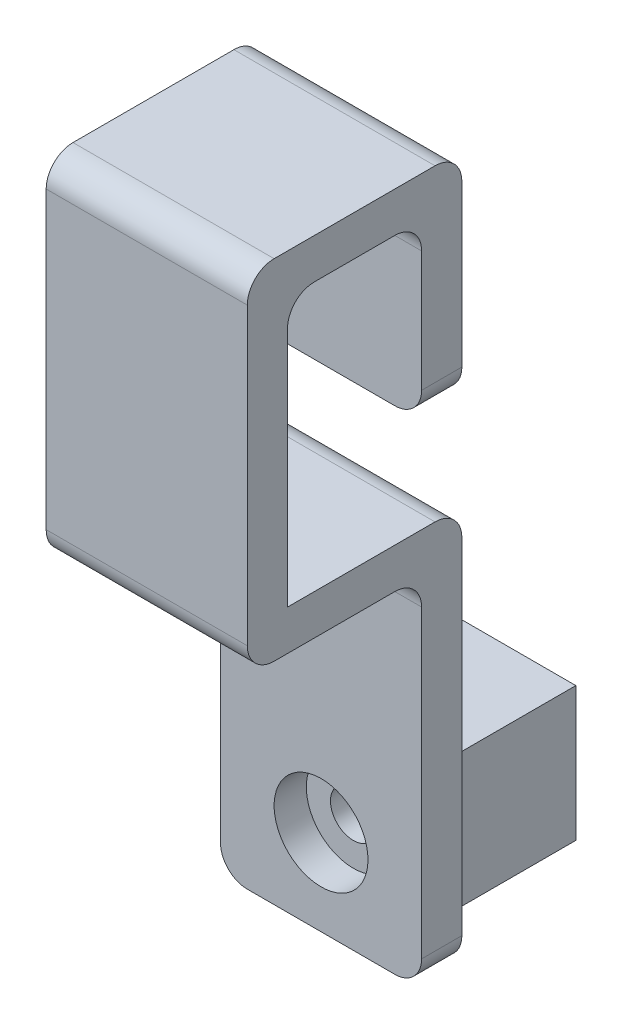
from build123d import *

# Parameters (mm, degrees)
SZKIC1_W                                          = 10
SZKIC1_H                                          = 10
DODANIE_WYCI_GNI_CIE1_DEPTH                       = 11
SZKIC2_W                                          = 15
SZKIC2_H                                          = 29.721694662
DODANIE_WYCI_GNI_CIE2_DEPTH                       = 3
SZKIC3_W                                          = 15
SZKIC3_H                                          = 3
DODANIE_WYCI_GNI_CIE3_DEPTH                       = 13
POG_BIENIE_WALCOWE_POD_M3_RUB_Z_BEM_S_D           = 3.4
POG_BIENIE_WALCOWE_POD_M3_RUB_Z_BEM_S_CBORE_D     = 7
POG_BIENIE_WALCOWE_POD_M3_RUB_Z_BEM_S_CBORE_DEPTH = 2.4
ZAOKR_GLENIE1_R                                   = 2
ZAOKR_GLENIE2_R                                   = 2
SZKIC6_W                                          = 15
SZKIC6_H                                          = 3
DODANIE_WYCI_GNI_CIE4_DEPTH                       = 23
SZKIC7_W                                          = 15
SZKIC7_H                                          = 3
DODANIE_WYCI_GNI_CIE5_DEPTH                       = 13
SZKIC8_W                                          = 15
SZKIC8_H                                          = 3
DODANIE_WYCI_GNI_CIE6_DEPTH                       = 13
ZAOKR_GLENIE3_R                                   = 2
ZAOKR_GLENIE4_R                                   = 2


with BuildPart() as part:
    # Szkic1 → Dodanie-wyci_gni_cie1 (new body)
    with BuildSketch(Plane.XY):
        Rectangle(SZKIC1_W, SZKIC1_H)
    extrude(amount=DODANIE_WYCI_GNI_CIE1_DEPTH)

    # Szkic2 → Dodanie-wyci_gni_cie2 (add)
    with BuildSketch(Plane.XY.offset(11)):
        with Locations((0, 8.459668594)):
            Rectangle(SZKIC2_W, SZKIC2_H)
    extrude(amount=DODANIE_WYCI_GNI_CIE2_DEPTH)

    # Szkic3 → Dodanie-wyci_gni_cie3 (add)
    with BuildSketch(Plane.XY.offset(14)):
        with Locations((0, 21.820515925)):
            Rectangle(SZKIC3_W, SZKIC3_H)
    extrude(amount=DODANIE_WYCI_GNI_CIE3_DEPTH)

    # Pog_bienie walcowe pod M3 _rub_ z _bem s (through all)
    with Locations(Plane.XY.offset(14)):
        with Locations((0, 0)):
            CounterBoreHole(POG_BIENIE_WALCOWE_POD_M3_RUB_Z_BEM_S_D / 2, POG_BIENIE_WALCOWE_POD_M3_RUB_Z_BEM_S_CBORE_D / 2, POG_BIENIE_WALCOWE_POD_M3_RUB_Z_BEM_S_CBORE_DEPTH)

    # Zaokr_glenie1
    zaokr_glenie1_edges = [part.edges().sort_by_distance(p)[0] for p in [
        (-7.5, -6.401178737, 12.5),
        (7.5, -6.401178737, 12.5),
    ]]
    fillet(zaokr_glenie1_edges, radius=ZAOKR_GLENIE1_R)

    # Zaokr_glenie2
    zaokr_glenie2_edges = [part.edges().sort_by_distance(p)[0] for p in [
        (0, 20.320515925, 14),
        (0, 23.320515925, 11),
    ]]
    fillet(zaokr_glenie2_edges, radius=ZAOKR_GLENIE2_R)

    # Szkic6 → Dodanie-wyci_gni_cie4 (add)
    with BuildSketch(Plane(origin=(0, 23.320515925, 0), x_dir=(1, 0, 0), z_dir=(0, 1, 0))):
        with Locations((0, -25.5)):
            Rectangle(SZKIC6_W, SZKIC6_H)
    extrude(amount=DODANIE_WYCI_GNI_CIE4_DEPTH)

    # Szkic7 → Dodanie-wyci_gni_cie5 (add)
    with BuildSketch(Plane(origin=(0, 0, 24), x_dir=(-1, 0, 0), z_dir=(0, 0, -1))):
        with Locations((0, 44.820515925)):
            Rectangle(SZKIC7_W, SZKIC7_H)
    extrude(amount=DODANIE_WYCI_GNI_CIE5_DEPTH)

    # Szkic8 → Dodanie-wyci_gni_cie6 (add)
    with BuildSketch(Plane.XZ.offset(-43.320515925)):
        with Locations((0, 12.5)):
            Rectangle(SZKIC8_W, SZKIC8_H)
    extrude(amount=DODANIE_WYCI_GNI_CIE6_DEPTH)

    # Zaokr_glenie3
    zaokr_glenie3_edges = [part.edges().sort_by_distance(p)[0] for p in [
        (0, 46.320515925, 11),
        (0, 46.320515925, 27),
        (0, 20.320515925, 27),
        (0, 43.320515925, 24),
        (0, 43.320515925, 14),
    ]]
    fillet(zaokr_glenie3_edges, radius=ZAOKR_GLENIE3_R)

    # Zaokr_glenie4
    zaokr_glenie4_edges = [part.edges().sort_by_distance(p)[0] for p in [
        (7.5, 30.320515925, 12.5),
        (-7.5, 30.320515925, 12.5),
    ]]
    fillet(zaokr_glenie4_edges, radius=ZAOKR_GLENIE4_R)


solid = part.part
